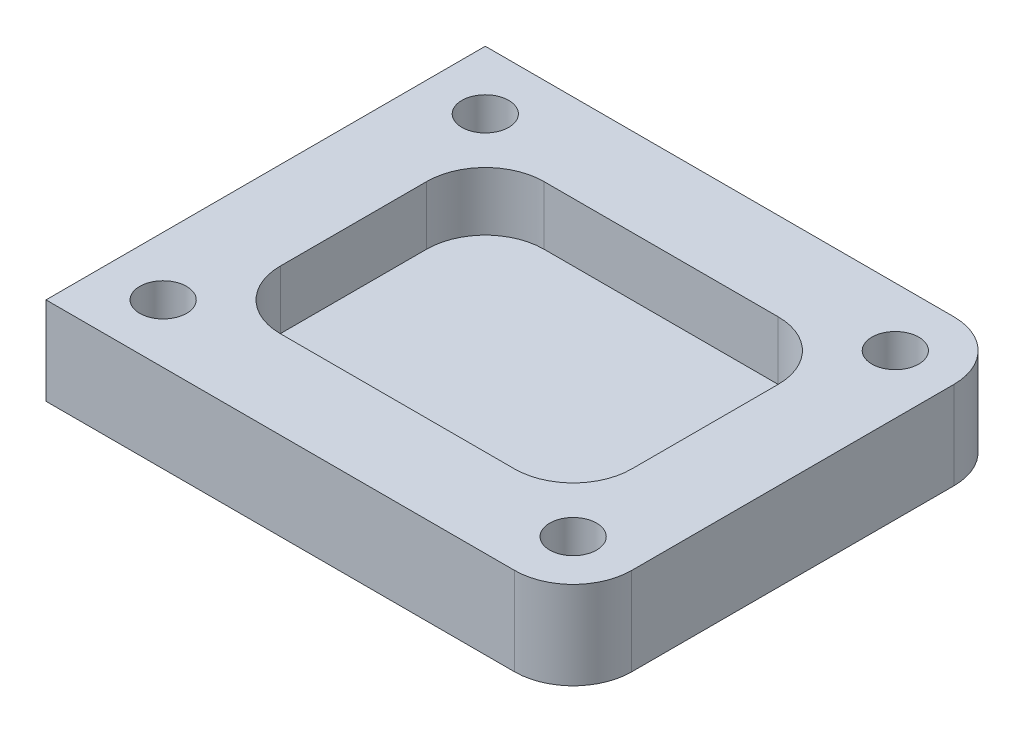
from build123d import *

# Parameters (mm, degrees)
SKETCH1_W                  = 180
SKETCH1_H                  = 150
BOSS_EXTRUDE1_DEPTH        = 30
F_16_0MM_DOWEL_HOLE1_D     = 16
F_16_0MM_DOWEL_HOLE1_DEPTH = 15
F_16_0MM_DOWEL_HOLE1_TIP   = 4.806884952
SKETCH5_W                  = 120
SKETCH5_H                  = 90
CUT_EXTRUDE1_DEPTH         = 20
FILLET1_R                  = 20
FILLET2_R                  = 20


with BuildPart() as part:
    # Sketch1 → Boss-Extrude1 (new body)
    with BuildSketch(Plane(origin=(0, 0, 0), x_dir=(1, 0, 0), z_dir=(0, 1, 0))):
        Rectangle(SKETCH1_W, SKETCH1_H)
    extrude(amount=BOSS_EXTRUDE1_DEPTH)

    # 16.0mm Dowel Hole1
    with Locations(Plane(origin=(-70, 30, 55), x_dir=(0, 0, 1), z_dir=(0, 1, 0))):
        with Locations((0, 0), (-110, 0), (-110, 140), (0, 140)):
            Hole(F_16_0MM_DOWEL_HOLE1_D / 2, depth=F_16_0MM_DOWEL_HOLE1_DEPTH)
            with Locations((0, 0, -(F_16_0MM_DOWEL_HOLE1_DEPTH + F_16_0MM_DOWEL_HOLE1_TIP / 2))):  # 118° drill point
                Cone(0, F_16_0MM_DOWEL_HOLE1_D / 2, F_16_0MM_DOWEL_HOLE1_TIP, mode=Mode.SUBTRACT)

    # Sketch5 → Cut-Extrude1 (cut)
    with BuildSketch(Plane(origin=(0, 30, 0), x_dir=(1, 0, 0), z_dir=(0, 1, 0))):
        Rectangle(SKETCH5_W, SKETCH5_H)
    extrude(amount=-CUT_EXTRUDE1_DEPTH, mode=Mode.SUBTRACT)

    # Fillet1
    fillet1_edges = [part.edges().sort_by_distance(p)[0] for p in [
        (60, 20, -45),
        (-60, 20, -45),
        (-60, 20, 45),
        (60, 20, 45),
    ]]
    fillet(fillet1_edges, radius=FILLET1_R)

    # Fillet2
    fillet2_edges = [part.edges().sort_by_distance(p)[0] for p in [
        (90, 15, 75),
        (90, 15, -75),
    ]]
    fillet(fillet2_edges, radius=FILLET2_R)


solid = part.part
